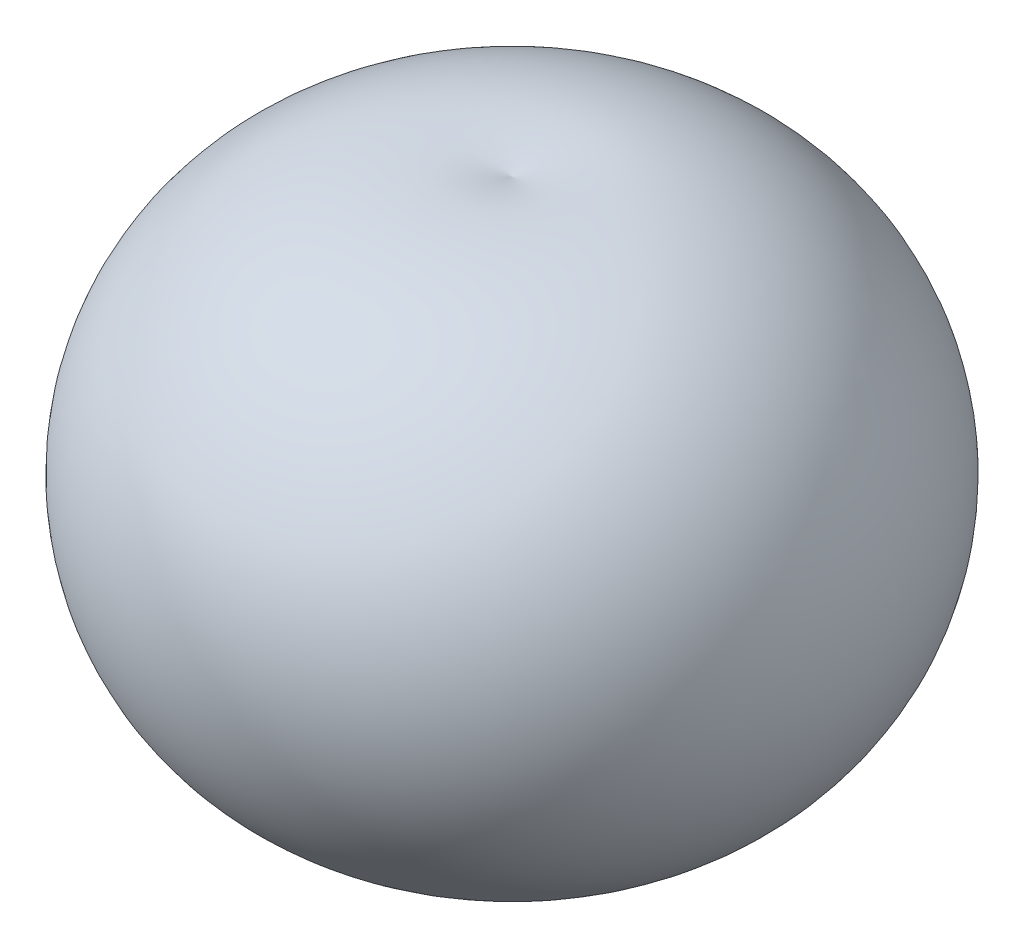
from build123d import *


with BuildPart() as part:
    # Sketch 1 → Revolve 1 (revolve)
    with BuildSketch(Plane.XY):
        with BuildLine():
            Line((0, 1745.561844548), (0, 2359.553093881))
            ThreePointArc((0, 2359.553093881), (-2414.551392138, 1129.768677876), (-1532.5, -1432.342458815))
            ThreePointArc((-1532.5, -1432.342458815), (-759.408162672, -1626.561019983), (0, -1384.298598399))
            Line((0, -1384.298598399), (0, -429.805610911))
            ThreePointArc((0, -429.805610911), (-1060.40298653, -387.934775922), (-1393.270435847, 619.739239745))
            ThreePointArc((-1393.270435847, 619.739239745), (-1211.063713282, 1299.743985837), (-730.941835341, 1814.611664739))
            ThreePointArc((-730.941835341, 1814.611664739), (-361.111399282, 1826.235381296), (0, 1745.561844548))
        make_face()
    revolve(axis=Axis((0, 2949.672093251, 0), (0, -1, 0)))


solid = part.part
